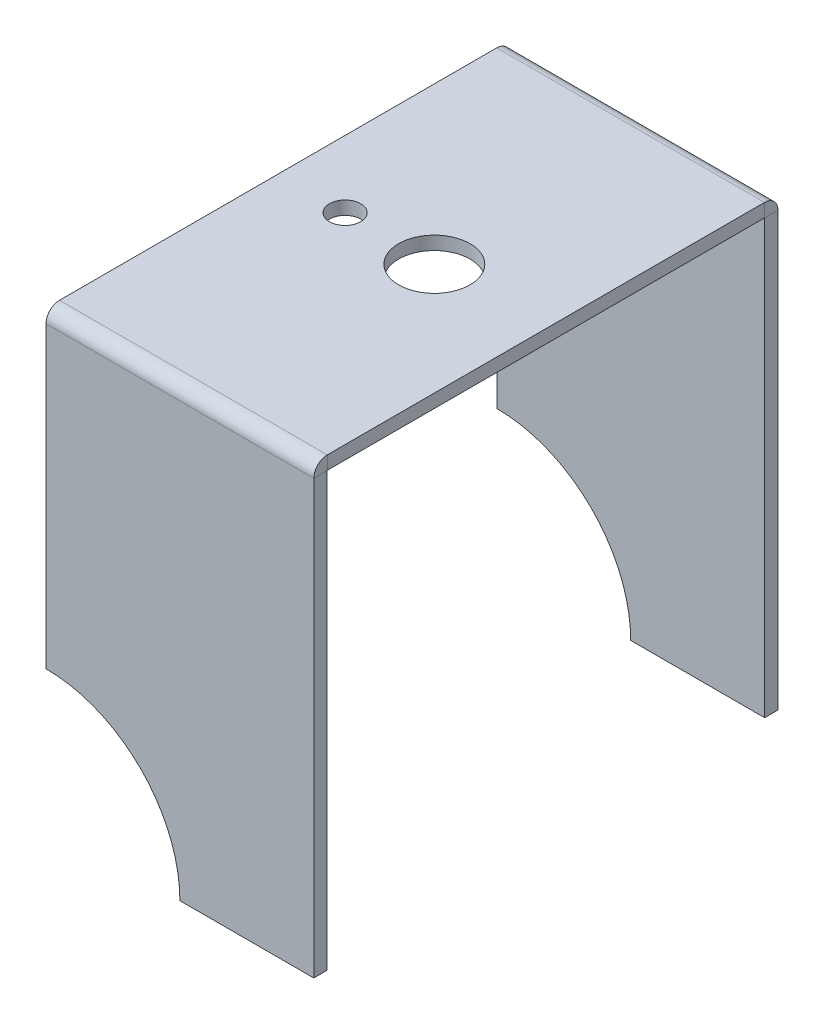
ISO-10303-21;
HEADER;
FILE_DESCRIPTION(('STEP AP214'),'2;1');
FILE_NAME('part.step','',(''),(''),'','','');
FILE_SCHEMA(('AUTOMOTIVE_DESIGN { 1 0 10303 214 1 1 1 1 }'));
ENDSEC;
DATA;
#1=APPLICATION_CONTEXT('core data for automotive mechanical design processes');
#2=APPLICATION_PROTOCOL_DEFINITION('international standard','automotive_design',2000,#1);
#3=PRODUCT_CONTEXT('',#1,'mechanical');
#4=PRODUCT('Part','Part','',(#3));
#5=PRODUCT_RELATED_PRODUCT_CATEGORY('part','',(#4));
#6=PRODUCT_DEFINITION_FORMATION('','',#4);
#7=PRODUCT_DEFINITION_CONTEXT('part definition',#1,'design');
#8=PRODUCT_DEFINITION('design','',#6,#7);
#9=PRODUCT_DEFINITION_SHAPE('','',#8);
#10=(LENGTH_UNIT() NAMED_UNIT(*) SI_UNIT(.MILLI.,.METRE.));
#11=(NAMED_UNIT(*) PLANE_ANGLE_UNIT() SI_UNIT($,.RADIAN.));
#12=(NAMED_UNIT(*) SI_UNIT($,.STERADIAN.) SOLID_ANGLE_UNIT());
#13=UNCERTAINTY_MEASURE_WITH_UNIT(LENGTH_MEASURE(1.E-05),#10,'distance_accuracy_value','');
#14=(GEOMETRIC_REPRESENTATION_CONTEXT(3) GLOBAL_UNCERTAINTY_ASSIGNED_CONTEXT((#13)) GLOBAL_UNIT_ASSIGNED_CONTEXT((#10,
#11,#12)) REPRESENTATION_CONTEXT('',''));
#15=CARTESIAN_POINT('',(0.,0.,0.));
#16=DIRECTION('',(0.,0.,1.));
#17=DIRECTION('',(1.,0.,0.));
#18=AXIS2_PLACEMENT_3D('',#15,#16,#17);
#19=CARTESIAN_POINT('',(-30.,1.5,-152.));
#20=DIRECTION('',(0.,1.,0.));
#21=DIRECTION('',(0.,0.,1.));
#22=AXIS2_PLACEMENT_3D('',#19,#20,#21);
#23=PLANE('',#22);
#24=CARTESIAN_POINT('',(-12.5,1.5,-76.));
#25=DIRECTION('',(0.,1.,0.));
#26=DIRECTION('',(0.,0.,1.));
#27=AXIS2_PLACEMENT_3D('',#24,#25,#26);
#28=CIRCLE('',#27,4.00000000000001);
#29=CARTESIAN_POINT('',(-12.5,1.5,-72.));
#30=VERTEX_POINT('',#29);
#31=EDGE_CURVE('E252',#30,#30,#28,.T.);
#32=ORIENTED_EDGE('',*,*,#31,.F.);
#33=EDGE_LOOP('',(#32));
#34=FACE_BOUND('',#33,.T.);
#35=CARTESIAN_POINT('',(-22.5,1.5,-76.));
#36=DIRECTION('',(0.,1.,0.));
#37=DIRECTION('',(0.,0.,1.));
#38=AXIS2_PLACEMENT_3D('',#35,#36,#37);
#39=CIRCLE('',#38,1.75);
#40=CARTESIAN_POINT('',(-22.5,1.5,-74.25));
#41=VERTEX_POINT('',#40);
#42=EDGE_CURVE('E246',#41,#41,#39,.T.);
#43=ORIENTED_EDGE('',*,*,#42,.F.);
#44=EDGE_LOOP('',(#43));
#45=FACE_BOUND('',#44,.T.);
#46=DIRECTION('',(0.,0.,-1.));
#47=VECTOR('',#46,1.);
#48=CARTESIAN_POINT('',(0.,1.5,0.));
#49=LINE('',#48,#47);
#50=CARTESIAN_POINT('',(0.,1.49999998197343,-51.505));
#51=VERTEX_POINT('',#50);
#52=CARTESIAN_POINT('',(0.,1.5,-100.495));
#53=VERTEX_POINT('',#52);
#54=EDGE_CURVE('E44',#51,#53,#49,.T.);
#55=ORIENTED_EDGE('',*,*,#54,.T.);
#56=DIRECTION('',(-1.,0.,0.));
#57=VECTOR('',#56,1.);
#58=CARTESIAN_POINT('',(-30.,1.5,-100.495));
#59=LINE('',#58,#57);
#60=CARTESIAN_POINT('',(-30.,1.5000000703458,-100.495));
#61=VERTEX_POINT('',#60);
#62=EDGE_CURVE('E265',#53,#61,#59,.T.);
#63=ORIENTED_EDGE('',*,*,#62,.T.);
#64=DIRECTION('',(0.,0.,1.));
#65=VECTOR('',#64,1.);
#66=CARTESIAN_POINT('',(-30.,1.5,-15.));
#67=LINE('',#66,#65);
#68=CARTESIAN_POINT('',(-30.,1.49999996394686,-51.505));
#69=VERTEX_POINT('',#68);
#70=EDGE_CURVE('E258',#61,#69,#67,.T.);
#71=ORIENTED_EDGE('',*,*,#70,.T.);
#72=DIRECTION('',(-1.,0.,0.));
#73=VECTOR('',#72,1.);
#74=CARTESIAN_POINT('',(-30.,1.5,-51.505));
#75=LINE('',#74,#73);
#76=EDGE_CURVE('E255',#51,#69,#75,.T.);
#77=ORIENTED_EDGE('',*,*,#76,.F.);
#78=EDGE_LOOP('',(#55,#63,#71,#77));
#79=FACE_BOUND('',#78,.T.);
#80=ADVANCED_FACE('F40',(#34,#45,#79),#23,.T.);
#81=CARTESIAN_POINT('',(-30.,1.5,-15.));
#82=DIRECTION('',(1.,0.,0.));
#83=DIRECTION('',(0.,0.,-1.));
#84=AXIS2_PLACEMENT_3D('',#81,#82,#83);
#85=PLANE('',#84);
#86=DIRECTION('',(0.,1.,0.));
#87=VECTOR('',#86,1.);
#88=CARTESIAN_POINT('',(-30.,1.49999999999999,-100.495));
#89=LINE('',#88,#87);
#90=CARTESIAN_POINT('',(-30.,0.,-100.495));
#91=VERTEX_POINT('',#90);
#92=EDGE_CURVE('E12',#91,#61,#89,.T.);
#93=ORIENTED_EDGE('',*,*,#92,.F.);
#94=DIRECTION('',(0.,0.,1.));
#95=VECTOR('',#94,1.);
#96=CARTESIAN_POINT('',(-30.,0.,-15.));
#97=LINE('',#96,#95);
#98=CARTESIAN_POINT('',(-30.,-3.60531418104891E-08,-51.505));
#99=VERTEX_POINT('',#98);
#100=EDGE_CURVE('E57',#91,#99,#97,.T.);
#101=ORIENTED_EDGE('',*,*,#100,.T.);
#102=DIRECTION('',(0.,1.,0.));
#103=VECTOR('',#102,1.);
#104=CARTESIAN_POINT('',(-30.,1.5,-51.505));
#105=LINE('',#104,#103);
#106=EDGE_CURVE('E257',#99,#69,#105,.T.);
#107=ORIENTED_EDGE('',*,*,#106,.T.);
#108=ORIENTED_EDGE('',*,*,#70,.F.);
#109=EDGE_LOOP('',(#93,#101,#107,#108));
#110=FACE_BOUND('',#109,.T.);
#111=ADVANCED_FACE('F42',(#110),#85,.F.);
#112=CARTESIAN_POINT('',(0.,1.5,0.));
#113=DIRECTION('',(-1.,0.,0.));
#114=DIRECTION('',(0.,0.,1.));
#115=AXIS2_PLACEMENT_3D('',#112,#113,#114);
#116=PLANE('',#115);
#117=DIRECTION('',(0.,-1.,0.));
#118=VECTOR('',#117,1.);
#119=CARTESIAN_POINT('',(0.,1.49999999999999,-100.495));
#120=LINE('',#119,#118);
#121=CARTESIAN_POINT('',(0.,0.,-100.495));
#122=VERTEX_POINT('',#121);
#123=EDGE_CURVE('E268',#53,#122,#120,.T.);
#124=ORIENTED_EDGE('',*,*,#123,.F.);
#125=ORIENTED_EDGE('',*,*,#54,.F.);
#126=DIRECTION('',(0.,-1.,0.));
#127=VECTOR('',#126,1.);
#128=CARTESIAN_POINT('',(0.,1.5,-51.505));
#129=LINE('',#128,#127);
#130=CARTESIAN_POINT('',(0.,0.,-51.505));
#131=VERTEX_POINT('',#130);
#132=EDGE_CURVE('E263',#51,#131,#129,.T.);
#133=ORIENTED_EDGE('',*,*,#132,.T.);
#134=DIRECTION('',(0.,0.,-1.));
#135=VECTOR('',#134,1.);
#136=CARTESIAN_POINT('',(0.,0.,0.));
#137=LINE('',#136,#135);
#138=EDGE_CURVE('E65',#131,#122,#137,.T.);
#139=ORIENTED_EDGE('',*,*,#138,.T.);
#140=EDGE_LOOP('',(#124,#125,#133,#139));
#141=FACE_BOUND('',#140,.T.);
#142=ADVANCED_FACE('F279',(#141),#116,.F.);
#143=CARTESIAN_POINT('',(-30.,0.,-152.));
#144=DIRECTION('',(0.,1.,0.));
#145=DIRECTION('',(0.,0.,1.));
#146=AXIS2_PLACEMENT_3D('',#143,#144,#145);
#147=PLANE('',#146);
#148=DIRECTION('',(-1.,0.,0.));
#149=VECTOR('',#148,1.);
#150=CARTESIAN_POINT('',(-30.,0.,-100.495));
#151=LINE('',#150,#149);
#152=EDGE_CURVE('E49',#122,#91,#151,.T.);
#153=ORIENTED_EDGE('',*,*,#152,.F.);
#154=ORIENTED_EDGE('',*,*,#138,.F.);
#155=DIRECTION('',(-1.,0.,0.));
#156=VECTOR('',#155,1.);
#157=CARTESIAN_POINT('',(-30.,0.,-51.505));
#158=LINE('',#157,#156);
#159=EDGE_CURVE('E261',#131,#99,#158,.T.);
#160=ORIENTED_EDGE('',*,*,#159,.T.);
#161=ORIENTED_EDGE('',*,*,#100,.F.);
#162=EDGE_LOOP('',(#153,#154,#160,#161));
#163=FACE_BOUND('',#162,.T.);
#164=CARTESIAN_POINT('',(-22.5,0.,-76.));
#165=DIRECTION('',(0.,1.,0.));
#166=DIRECTION('',(0.,0.,1.));
#167=AXIS2_PLACEMENT_3D('',#164,#165,#166);
#168=CIRCLE('',#167,1.75);
#169=CARTESIAN_POINT('',(-22.5,0.,-74.25));
#170=VERTEX_POINT('',#169);
#171=EDGE_CURVE('E243',#170,#170,#168,.T.);
#172=ORIENTED_EDGE('',*,*,#171,.T.);
#173=EDGE_LOOP('',(#172));
#174=FACE_BOUND('',#173,.T.);
#175=CARTESIAN_POINT('',(-12.5,0.,-76.));
#176=DIRECTION('',(0.,1.,0.));
#177=DIRECTION('',(0.,0.,1.));
#178=AXIS2_PLACEMENT_3D('',#175,#176,#177);
#179=CIRCLE('',#178,4.00000000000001);
#180=CARTESIAN_POINT('',(-12.5,0.,-72.));
#181=VERTEX_POINT('',#180);
#182=EDGE_CURVE('E249',#181,#181,#179,.T.);
#183=ORIENTED_EDGE('',*,*,#182,.T.);
#184=EDGE_LOOP('',(#183));
#185=FACE_BOUND('',#184,.T.);
#186=ADVANCED_FACE('F313',(#163,#174,#185),#147,.F.);
#187=CARTESIAN_POINT('',(-12.5,1.5,-76.));
#188=DIRECTION('',(0.,-1.,0.));
#189=DIRECTION('',(0.,0.,-1.));
#190=AXIS2_PLACEMENT_3D('',#187,#188,#189);
#191=CYLINDRICAL_SURFACE('',#190,4.00000000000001);
#192=ORIENTED_EDGE('',*,*,#31,.T.);
#193=EDGE_LOOP('',(#192));
#194=FACE_BOUND('',#193,.T.);
#195=ORIENTED_EDGE('',*,*,#182,.F.);
#196=EDGE_LOOP('',(#195));
#197=FACE_BOUND('',#196,.T.);
#198=ADVANCED_FACE('F371',(#194,#197),#191,.F.);
#199=CARTESIAN_POINT('',(-22.5,1.5,-76.));
#200=DIRECTION('',(0.,-1.,0.));
#201=DIRECTION('',(0.,0.,-1.));
#202=AXIS2_PLACEMENT_3D('',#199,#200,#201);
#203=CYLINDRICAL_SURFACE('',#202,1.75);
#204=ORIENTED_EDGE('',*,*,#42,.T.);
#205=EDGE_LOOP('',(#204));
#206=FACE_BOUND('',#205,.T.);
#207=ORIENTED_EDGE('',*,*,#171,.F.);
#208=EDGE_LOOP('',(#207));
#209=FACE_BOUND('',#208,.T.);
#210=ADVANCED_FACE('F378',(#206,#209),#203,.F.);
#211=CARTESIAN_POINT('',(0.,-0.00999996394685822,-51.505));
#212=DIRECTION('',(1.,0.,0.));
#213=DIRECTION('',(0.,0.,-1.));
#214=AXIS2_PLACEMENT_3D('',#211,#212,#213);
#215=PLANE('',#214);
#216=DIRECTION('',(0.,0.,-1.));
#217=VECTOR('',#216,1.);
#218=CARTESIAN_POINT('',(0.,-0.0100000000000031,-49.995));
#219=LINE('',#218,#217);
#220=CARTESIAN_POINT('',(0.,-0.010000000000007,-49.9950000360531));
#221=VERTEX_POINT('',#220);
#222=CARTESIAN_POINT('',(0.,-0.00999999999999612,-51.495));
#223=VERTEX_POINT('',#222);
#224=EDGE_CURVE('E195',#221,#223,#219,.T.);
#225=ORIENTED_EDGE('',*,*,#224,.T.);
#226=CARTESIAN_POINT('',(0.,-0.01,-51.505));
#227=DIRECTION('',(1.,0.,0.));
#228=DIRECTION('',(0.,0.,-1.));
#229=AXIS2_PLACEMENT_3D('',#226,#227,#228);
#230=CIRCLE('',#229,0.00999996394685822);
#231=EDGE_CURVE('E198',#223,#131,#230,.F.);
#232=ORIENTED_EDGE('',*,*,#231,.T.);
#233=ORIENTED_EDGE('',*,*,#132,.F.);
#234=CARTESIAN_POINT('',(0.,-0.00999996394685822,-51.505));
#235=DIRECTION('',(-1.,0.,0.));
#236=DIRECTION('',(0.,0.,1.));
#237=AXIS2_PLACEMENT_3D('',#234,#235,#236);
#238=CIRCLE('',#237,1.50999994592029);
#239=EDGE_CURVE('E237',#221,#51,#238,.T.);
#240=ORIENTED_EDGE('',*,*,#239,.F.);
#241=EDGE_LOOP('',(#225,#232,#233,#240));
#242=FACE_BOUND('',#241,.T.);
#243=ADVANCED_FACE('F318',(#242),#215,.T.);
#244=CARTESIAN_POINT('',(-30.,-0.00999996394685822,-51.505));
#245=DIRECTION('',(-1.,0.,0.));
#246=DIRECTION('',(0.,0.,1.));
#247=AXIS2_PLACEMENT_3D('',#244,#245,#246);
#248=PLANE('',#247);
#249=CARTESIAN_POINT('',(-30.,-0.01,-51.505));
#250=DIRECTION('',(1.,0.,0.));
#251=DIRECTION('',(0.,0.,-1.));
#252=AXIS2_PLACEMENT_3D('',#249,#250,#251);
#253=CIRCLE('',#252,0.00999996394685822);
#254=CARTESIAN_POINT('',(-30.,-0.00999999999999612,-51.495));
#255=VERTEX_POINT('',#254);
#256=EDGE_CURVE('E234',#99,#255,#253,.T.);
#257=ORIENTED_EDGE('',*,*,#256,.T.);
#258=DIRECTION('',(0.,0.,1.));
#259=VECTOR('',#258,1.);
#260=CARTESIAN_POINT('',(-30.,-0.0100000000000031,-49.995));
#261=LINE('',#260,#259);
#262=CARTESIAN_POINT('',(-30.,-0.0100000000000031,-49.995));
#263=VERTEX_POINT('',#262);
#264=EDGE_CURVE('E225',#255,#263,#261,.T.);
#265=ORIENTED_EDGE('',*,*,#264,.T.);
#266=CARTESIAN_POINT('',(-30.,-0.00999996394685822,-51.505));
#267=DIRECTION('',(1.,0.,0.));
#268=DIRECTION('',(0.,0.,-1.));
#269=AXIS2_PLACEMENT_3D('',#266,#267,#268);
#270=CIRCLE('',#269,1.50999994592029);
#271=EDGE_CURVE('E240',#69,#263,#270,.T.);
#272=ORIENTED_EDGE('',*,*,#271,.F.);
#273=ORIENTED_EDGE('',*,*,#106,.F.);
#274=EDGE_LOOP('',(#257,#265,#272,#273));
#275=FACE_BOUND('',#274,.T.);
#276=ADVANCED_FACE('F334',(#275),#248,.T.);
#277=CARTESIAN_POINT('',(-45.1879131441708,-0.01,-51.505));
#278=DIRECTION('',(1.,0.,0.));
#279=DIRECTION('',(0.,0.,-1.));
#280=AXIS2_PLACEMENT_3D('',#277,#278,#279);
#281=CYLINDRICAL_SURFACE('',#280,1.50999996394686);
#282=ORIENTED_EDGE('',*,*,#76,.T.);
#283=ORIENTED_EDGE('',*,*,#271,.T.);
#284=DIRECTION('',(-1.,0.,0.));
#285=VECTOR('',#284,1.);
#286=CARTESIAN_POINT('',(-30.,-0.0100000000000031,-49.995));
#287=LINE('',#286,#285);
#288=EDGE_CURVE('E210',#221,#263,#287,.T.);
#289=ORIENTED_EDGE('',*,*,#288,.F.);
#290=ORIENTED_EDGE('',*,*,#239,.T.);
#291=EDGE_LOOP('',(#282,#283,#289,#290));
#292=FACE_BOUND('',#291,.T.);
#293=ADVANCED_FACE('F322',(#292),#281,.T.);
#294=CARTESIAN_POINT('',(-45.1879131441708,-0.01,-51.505));
#295=DIRECTION('',(1.,0.,0.));
#296=DIRECTION('',(0.,0.,-1.));
#297=AXIS2_PLACEMENT_3D('',#294,#295,#296);
#298=CYLINDRICAL_SURFACE('',#297,0.00999996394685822);
#299=ORIENTED_EDGE('',*,*,#159,.F.);
#300=ORIENTED_EDGE('',*,*,#231,.F.);
#301=DIRECTION('',(-1.,0.,0.));
#302=VECTOR('',#301,1.);
#303=CARTESIAN_POINT('',(-30.,-0.00999999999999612,-51.495));
#304=LINE('',#303,#302);
#305=EDGE_CURVE('E228',#223,#255,#304,.T.);
#306=ORIENTED_EDGE('',*,*,#305,.T.);
#307=ORIENTED_EDGE('',*,*,#256,.F.);
#308=EDGE_LOOP('',(#299,#300,#306,#307));
#309=FACE_BOUND('',#308,.T.);
#310=ADVANCED_FACE('F337',(#309),#298,.F.);
#311=CARTESIAN_POINT('',(0.,-48.505,-49.9950000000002));
#312=DIRECTION('',(0.,1.,0.));
#313=DIRECTION('',(-1.,0.,0.));
#314=AXIS2_PLACEMENT_3D('',#311,#312,#313);
#315=PLANE('',#314);
#316=DIRECTION('',(1.,0.,0.));
#317=VECTOR('',#316,1.);
#318=CARTESIAN_POINT('',(0.,-48.505,-51.4950000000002));
#319=LINE('',#318,#317);
#320=CARTESIAN_POINT('',(-15.,-48.505,-51.4950000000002));
#321=VERTEX_POINT('',#320);
#322=CARTESIAN_POINT('',(0.,-48.505,-51.4950000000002));
#323=VERTEX_POINT('',#322);
#324=EDGE_CURVE('E223',#321,#323,#319,.T.);
#325=ORIENTED_EDGE('',*,*,#324,.T.);
#326=DIRECTION('',(0.,0.,-1.));
#327=VECTOR('',#326,1.);
#328=CARTESIAN_POINT('',(0.,-48.505,-49.9950000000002));
#329=LINE('',#328,#327);
#330=CARTESIAN_POINT('',(0.,-48.505,-49.9950000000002));
#331=VERTEX_POINT('',#330);
#332=EDGE_CURVE('E199',#331,#323,#329,.T.);
#333=ORIENTED_EDGE('',*,*,#332,.F.);
#334=DIRECTION('',(1.,0.,0.));
#335=VECTOR('',#334,1.);
#336=CARTESIAN_POINT('',(0.,-48.505,-49.9950000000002));
#337=LINE('',#336,#335);
#338=CARTESIAN_POINT('',(-15.,-48.505,-49.9950000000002));
#339=VERTEX_POINT('',#338);
#340=EDGE_CURVE('E204',#339,#331,#337,.T.);
#341=ORIENTED_EDGE('',*,*,#340,.F.);
#342=DIRECTION('',(0.,0.,-1.));
#343=VECTOR('',#342,1.);
#344=CARTESIAN_POINT('',(-15.,-48.505,-49.9950000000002));
#345=LINE('',#344,#343);
#346=EDGE_CURVE('E220',#339,#321,#345,.T.);
#347=ORIENTED_EDGE('',*,*,#346,.T.);
#348=EDGE_LOOP('',(#325,#333,#341,#347));
#349=FACE_BOUND('',#348,.T.);
#350=ADVANCED_FACE('F349',(#349),#315,.F.);
#351=CARTESIAN_POINT('',(-30.,-48.505,-49.9950000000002));
#352=DIRECTION('',(0.,0.,-1.));
#353=DIRECTION('',(0.,1.,0.));
#354=AXIS2_PLACEMENT_3D('',#351,#352,#353);
#355=CYLINDRICAL_SURFACE('',#354,15.);
#356=CARTESIAN_POINT('',(-30.,-48.505,-51.4950000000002));
#357=DIRECTION('',(0.,0.,-1.));
#358=DIRECTION('',(0.,-1.,0.));
#359=AXIS2_PLACEMENT_3D('',#356,#357,#358);
#360=CIRCLE('',#359,15.);
#361=CARTESIAN_POINT('',(-30.,-33.505,-51.4950000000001));
#362=VERTEX_POINT('',#361);
#363=EDGE_CURVE('E218',#362,#321,#360,.T.);
#364=ORIENTED_EDGE('',*,*,#363,.T.);
#365=ORIENTED_EDGE('',*,*,#346,.F.);
#366=CARTESIAN_POINT('',(-30.,-48.505,-49.9950000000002));
#367=DIRECTION('',(0.,0.,-1.));
#368=DIRECTION('',(0.,-1.,0.));
#369=AXIS2_PLACEMENT_3D('',#366,#367,#368);
#370=CIRCLE('',#369,15.);
#371=CARTESIAN_POINT('',(-30.,-33.505,-49.9950000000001));
#372=VERTEX_POINT('',#371);
#373=EDGE_CURVE('E206',#372,#339,#370,.T.);
#374=ORIENTED_EDGE('',*,*,#373,.F.);
#375=DIRECTION('',(0.,0.,-1.));
#376=VECTOR('',#375,1.);
#377=CARTESIAN_POINT('',(-30.,-33.505,-49.9950000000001));
#378=LINE('',#377,#376);
#379=EDGE_CURVE('E215',#372,#362,#378,.T.);
#380=ORIENTED_EDGE('',*,*,#379,.T.);
#381=EDGE_LOOP('',(#364,#365,#374,#380));
#382=FACE_BOUND('',#381,.T.);
#383=ADVANCED_FACE('F352',(#382),#355,.F.);
#384=CARTESIAN_POINT('',(-30.,103.495,-49.9949999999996));
#385=DIRECTION('',(0.,0.,1.));
#386=DIRECTION('',(0.,-1.,0.));
#387=AXIS2_PLACEMENT_3D('',#384,#385,#386);
#388=PLANE('',#387);
#389=DIRECTION('',(0.,1.,0.));
#390=VECTOR('',#389,1.);
#391=CARTESIAN_POINT('',(0.,-48.505,-49.9950000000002));
#392=LINE('',#391,#390);
#393=EDGE_CURVE('E212',#331,#221,#392,.T.);
#394=ORIENTED_EDGE('',*,*,#393,.T.);
#395=ORIENTED_EDGE('',*,*,#288,.T.);
#396=DIRECTION('',(0.,-1.,0.));
#397=VECTOR('',#396,1.);
#398=CARTESIAN_POINT('',(-30.,-33.505,-49.9950000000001));
#399=LINE('',#398,#397);
#400=EDGE_CURVE('E208',#263,#372,#399,.T.);
#401=ORIENTED_EDGE('',*,*,#400,.T.);
#402=ORIENTED_EDGE('',*,*,#373,.T.);
#403=ORIENTED_EDGE('',*,*,#340,.T.);
#404=EDGE_LOOP('',(#394,#395,#401,#402,#403));
#405=FACE_BOUND('',#404,.T.);
#406=ADVANCED_FACE('F326',(#405),#388,.T.);
#407=CARTESIAN_POINT('',(-30.,-33.505,-49.9950000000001));
#408=DIRECTION('',(1.,0.,0.));
#409=DIRECTION('',(0.,1.,0.));
#410=AXIS2_PLACEMENT_3D('',#407,#408,#409);
#411=PLANE('',#410);
#412=ORIENTED_EDGE('',*,*,#264,.F.);
#413=DIRECTION('',(0.,-1.,0.));
#414=VECTOR('',#413,1.);
#415=CARTESIAN_POINT('',(-30.,-33.505,-51.4950000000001));
#416=LINE('',#415,#414);
#417=EDGE_CURVE('E202',#255,#362,#416,.T.);
#418=ORIENTED_EDGE('',*,*,#417,.T.);
#419=ORIENTED_EDGE('',*,*,#379,.F.);
#420=ORIENTED_EDGE('',*,*,#400,.F.);
#421=EDGE_LOOP('',(#412,#418,#419,#420));
#422=FACE_BOUND('',#421,.T.);
#423=ADVANCED_FACE('F331',(#422),#411,.F.);
#424=CARTESIAN_POINT('',(-30.,103.495,-51.4949999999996));
#425=DIRECTION('',(0.,0.,1.));
#426=DIRECTION('',(0.,-1.,0.));
#427=AXIS2_PLACEMENT_3D('',#424,#425,#426);
#428=PLANE('',#427);
#429=ORIENTED_EDGE('',*,*,#305,.F.);
#430=DIRECTION('',(0.,1.,0.));
#431=VECTOR('',#430,1.);
#432=CARTESIAN_POINT('',(0.,-48.505,-51.4950000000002));
#433=LINE('',#432,#431);
#434=EDGE_CURVE('E196',#323,#223,#433,.T.);
#435=ORIENTED_EDGE('',*,*,#434,.F.);
#436=ORIENTED_EDGE('',*,*,#324,.F.);
#437=ORIENTED_EDGE('',*,*,#363,.F.);
#438=ORIENTED_EDGE('',*,*,#417,.F.);
#439=EDGE_LOOP('',(#429,#435,#436,#437,#438));
#440=FACE_BOUND('',#439,.T.);
#441=ADVANCED_FACE('F341',(#440),#428,.F.);
#442=CARTESIAN_POINT('',(0.,-48.505,-49.9950000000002));
#443=DIRECTION('',(-1.,0.,0.));
#444=DIRECTION('',(0.,-1.,0.));
#445=AXIS2_PLACEMENT_3D('',#442,#443,#444);
#446=PLANE('',#445);
#447=ORIENTED_EDGE('',*,*,#224,.F.);
#448=ORIENTED_EDGE('',*,*,#393,.F.);
#449=ORIENTED_EDGE('',*,*,#332,.T.);
#450=ORIENTED_EDGE('',*,*,#434,.T.);
#451=EDGE_LOOP('',(#447,#448,#449,#450));
#452=FACE_BOUND('',#451,.T.);
#453=ADVANCED_FACE('F345',(#452),#446,.F.);
#454=CARTESIAN_POINT('',(0.,-0.0100000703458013,-100.495));
#455=DIRECTION('',(1.,0.,0.));
#456=DIRECTION('',(0.,1.,0.));
#457=AXIS2_PLACEMENT_3D('',#454,#455,#456);
#458=PLANE('',#457);
#459=ORIENTED_EDGE('',*,*,#123,.T.);
#460=CARTESIAN_POINT('',(0.,-0.01,-100.495));
#461=DIRECTION('',(-1.,0.,0.));
#462=DIRECTION('',(0.,0.,1.));
#463=AXIS2_PLACEMENT_3D('',#460,#461,#462);
#464=CIRCLE('',#463,0.0100000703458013);
#465=CARTESIAN_POINT('',(0.,-0.01000000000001,-100.505));
#466=VERTEX_POINT('',#465);
#467=EDGE_CURVE('E182',#122,#466,#464,.T.);
#468=ORIENTED_EDGE('',*,*,#467,.T.);
#469=DIRECTION('',(0.,0.,1.));
#470=VECTOR('',#469,1.);
#471=CARTESIAN_POINT('',(0.,-0.01000000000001,-102.005));
#472=LINE('',#471,#470);
#473=CARTESIAN_POINT('',(0.,-0.01000000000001,-102.005));
#474=VERTEX_POINT('',#473);
#475=EDGE_CURVE('E153',#474,#466,#472,.T.);
#476=ORIENTED_EDGE('',*,*,#475,.F.);
#477=CARTESIAN_POINT('',(0.,-0.0100000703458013,-100.495));
#478=DIRECTION('',(-1.,0.,0.));
#479=DIRECTION('',(0.,-1.,0.));
#480=AXIS2_PLACEMENT_3D('',#477,#478,#479);
#481=CIRCLE('',#480,1.5100001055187);
#482=EDGE_CURVE('E189',#53,#474,#481,.T.);
#483=ORIENTED_EDGE('',*,*,#482,.F.);
#484=EDGE_LOOP('',(#459,#468,#476,#483));
#485=FACE_BOUND('',#484,.T.);
#486=ADVANCED_FACE('F286',(#485),#458,.T.);
#487=CARTESIAN_POINT('',(-30.,-0.0100000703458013,-100.495));
#488=DIRECTION('',(-1.,0.,0.));
#489=DIRECTION('',(0.,0.,1.));
#490=AXIS2_PLACEMENT_3D('',#487,#488,#489);
#491=PLANE('',#490);
#492=CARTESIAN_POINT('',(-30.,-0.01,-100.495));
#493=DIRECTION('',(-1.,0.,0.));
#494=DIRECTION('',(0.,0.,1.));
#495=AXIS2_PLACEMENT_3D('',#492,#493,#494);
#496=CIRCLE('',#495,0.0100000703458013);
#497=CARTESIAN_POINT('',(-30.,-0.01000000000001,-100.505));
#498=VERTEX_POINT('',#497);
#499=EDGE_CURVE('E185',#498,#91,#496,.F.);
#500=ORIENTED_EDGE('',*,*,#499,.T.);
#501=ORIENTED_EDGE('',*,*,#92,.T.);
#502=CARTESIAN_POINT('',(-30.,-0.0100000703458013,-100.495));
#503=DIRECTION('',(1.,0.,0.));
#504=DIRECTION('',(0.,0.,-1.));
#505=AXIS2_PLACEMENT_3D('',#502,#503,#504);
#506=CIRCLE('',#505,1.5100001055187);
#507=CARTESIAN_POINT('',(-30.,-0.010000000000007,-102.005000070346));
#508=VERTEX_POINT('',#507);
#509=EDGE_CURVE('E192',#508,#61,#506,.T.);
#510=ORIENTED_EDGE('',*,*,#509,.F.);
#511=DIRECTION('',(0.,0.,-1.));
#512=VECTOR('',#511,1.);
#513=CARTESIAN_POINT('',(-30.,-0.01000000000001,-102.005));
#514=LINE('',#513,#512);
#515=EDGE_CURVE('E303',#498,#508,#514,.T.);
#516=ORIENTED_EDGE('',*,*,#515,.F.);
#517=EDGE_LOOP('',(#500,#501,#510,#516));
#518=FACE_BOUND('',#517,.T.);
#519=ADVANCED_FACE('F308',(#518),#491,.T.);
#520=CARTESIAN_POINT('',(15.1879131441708,-0.01,-100.495));
#521=DIRECTION('',(-1.,0.,0.));
#522=DIRECTION('',(0.,0.,1.));
#523=AXIS2_PLACEMENT_3D('',#520,#521,#522);
#524=CYLINDRICAL_SURFACE('',#523,1.5100000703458);
#525=DIRECTION('',(-1.,0.,0.));
#526=VECTOR('',#525,1.);
#527=CARTESIAN_POINT('',(-30.,-0.01000000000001,-102.005));
#528=LINE('',#527,#526);
#529=EDGE_CURVE('E179',#474,#508,#528,.T.);
#530=ORIENTED_EDGE('',*,*,#529,.T.);
#531=ORIENTED_EDGE('',*,*,#509,.T.);
#532=ORIENTED_EDGE('',*,*,#62,.F.);
#533=ORIENTED_EDGE('',*,*,#482,.T.);
#534=EDGE_LOOP('',(#530,#531,#532,#533));
#535=FACE_BOUND('',#534,.T.);
#536=ADVANCED_FACE('F284',(#535),#524,.T.);
#537=CARTESIAN_POINT('',(15.1879131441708,-0.01,-100.495));
#538=DIRECTION('',(-1.,0.,0.));
#539=DIRECTION('',(0.,0.,1.));
#540=AXIS2_PLACEMENT_3D('',#537,#538,#539);
#541=CYLINDRICAL_SURFACE('',#540,0.0100000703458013);
#542=DIRECTION('',(-1.,0.,0.));
#543=VECTOR('',#542,1.);
#544=CARTESIAN_POINT('',(-30.,-0.01000000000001,-100.505));
#545=LINE('',#544,#543);
#546=EDGE_CURVE('E157',#466,#498,#545,.T.);
#547=ORIENTED_EDGE('',*,*,#546,.F.);
#548=ORIENTED_EDGE('',*,*,#467,.F.);
#549=ORIENTED_EDGE('',*,*,#152,.T.);
#550=ORIENTED_EDGE('',*,*,#499,.F.);
#551=EDGE_LOOP('',(#547,#548,#549,#550));
#552=FACE_BOUND('',#551,.T.);
#553=ADVANCED_FACE('F312',(#552),#541,.F.);
#554=CARTESIAN_POINT('',(-30.,-48.505,-102.005));
#555=DIRECTION('',(0.,0.,1.));
#556=DIRECTION('',(0.,-1.,0.));
#557=AXIS2_PLACEMENT_3D('',#554,#555,#556);
#558=CYLINDRICAL_SURFACE('',#557,15.);
#559=CARTESIAN_POINT('',(-30.,-48.505,-100.505));
#560=DIRECTION('',(0.,0.,1.));
#561=DIRECTION('',(0.,1.,0.));
#562=AXIS2_PLACEMENT_3D('',#559,#560,#561);
#563=CIRCLE('',#562,15.);
#564=CARTESIAN_POINT('',(-15.,-48.505,-100.505));
#565=VERTEX_POINT('',#564);
#566=CARTESIAN_POINT('',(-30.,-33.505,-100.505));
#567=VERTEX_POINT('',#566);
#568=EDGE_CURVE('E163',#565,#567,#563,.T.);
#569=ORIENTED_EDGE('',*,*,#568,.T.);
#570=DIRECTION('',(0.,0.,1.));
#571=VECTOR('',#570,1.);
#572=CARTESIAN_POINT('',(-30.,-33.505,-102.005));
#573=LINE('',#572,#571);
#574=CARTESIAN_POINT('',(-30.,-33.505,-102.005));
#575=VERTEX_POINT('',#574);
#576=EDGE_CURVE('E186',#575,#567,#573,.T.);
#577=ORIENTED_EDGE('',*,*,#576,.F.);
#578=CARTESIAN_POINT('',(-30.,-48.505,-102.005));
#579=DIRECTION('',(0.,0.,1.));
#580=DIRECTION('',(0.,1.,0.));
#581=AXIS2_PLACEMENT_3D('',#578,#579,#580);
#582=CIRCLE('',#581,15.);
#583=CARTESIAN_POINT('',(-15.,-48.505,-102.005));
#584=VERTEX_POINT('',#583);
#585=EDGE_CURVE('E290',#584,#575,#582,.T.);
#586=ORIENTED_EDGE('',*,*,#585,.F.);
#587=DIRECTION('',(0.,0.,1.));
#588=VECTOR('',#587,1.);
#589=CARTESIAN_POINT('',(-15.,-48.505,-102.005));
#590=LINE('',#589,#588);
#591=EDGE_CURVE('E167',#584,#565,#590,.T.);
#592=ORIENTED_EDGE('',*,*,#591,.T.);
#593=EDGE_LOOP('',(#569,#577,#586,#592));
#594=FACE_BOUND('',#593,.T.);
#595=ADVANCED_FACE('F299',(#594),#558,.F.);
#596=CARTESIAN_POINT('',(0.,-48.505,-102.005));
#597=DIRECTION('',(0.,1.,0.));
#598=DIRECTION('',(1.,0.,0.));
#599=AXIS2_PLACEMENT_3D('',#596,#597,#598);
#600=PLANE('',#599);
#601=DIRECTION('',(-1.,0.,0.));
#602=VECTOR('',#601,1.);
#603=CARTESIAN_POINT('',(0.,-48.505,-100.505));
#604=LINE('',#603,#602);
#605=CARTESIAN_POINT('',(0.,-48.505,-100.505));
#606=VERTEX_POINT('',#605);
#607=EDGE_CURVE('E160',#606,#565,#604,.T.);
#608=ORIENTED_EDGE('',*,*,#607,.T.);
#609=ORIENTED_EDGE('',*,*,#591,.F.);
#610=DIRECTION('',(-1.,0.,0.));
#611=VECTOR('',#610,1.);
#612=CARTESIAN_POINT('',(0.,-48.505,-102.005));
#613=LINE('',#612,#611);
#614=CARTESIAN_POINT('',(0.,-48.505,-102.005));
#615=VERTEX_POINT('',#614);
#616=EDGE_CURVE('E171',#615,#584,#613,.T.);
#617=ORIENTED_EDGE('',*,*,#616,.F.);
#618=DIRECTION('',(0.,0.,1.));
#619=VECTOR('',#618,1.);
#620=CARTESIAN_POINT('',(0.,-48.505,-102.005));
#621=LINE('',#620,#619);
#622=EDGE_CURVE('E151',#615,#606,#621,.T.);
#623=ORIENTED_EDGE('',*,*,#622,.T.);
#624=EDGE_LOOP('',(#608,#609,#617,#623));
#625=FACE_BOUND('',#624,.T.);
#626=ADVANCED_FACE('F170',(#625),#600,.F.);
#627=CARTESIAN_POINT('',(-30.,-48.505,-102.005));
#628=DIRECTION('',(0.,0.,-1.));
#629=DIRECTION('',(0.,1.,0.));
#630=AXIS2_PLACEMENT_3D('',#627,#628,#629);
#631=PLANE('',#630);
#632=ORIENTED_EDGE('',*,*,#529,.F.);
#633=DIRECTION('',(0.,-1.,0.));
#634=VECTOR('',#633,1.);
#635=CARTESIAN_POINT('',(0.,103.495,-102.005));
#636=LINE('',#635,#634);
#637=EDGE_CURVE('E172',#474,#615,#636,.T.);
#638=ORIENTED_EDGE('',*,*,#637,.T.);
#639=ORIENTED_EDGE('',*,*,#616,.T.);
#640=ORIENTED_EDGE('',*,*,#585,.T.);
#641=DIRECTION('',(0.,1.,0.));
#642=VECTOR('',#641,1.);
#643=CARTESIAN_POINT('',(-30.,88.495,-102.005));
#644=LINE('',#643,#642);
#645=EDGE_CURVE('E287',#575,#508,#644,.T.);
#646=ORIENTED_EDGE('',*,*,#645,.T.);
#647=EDGE_LOOP('',(#632,#638,#639,#640,#646));
#648=FACE_BOUND('',#647,.T.);
#649=ADVANCED_FACE('F295',(#648),#631,.T.);
#650=CARTESIAN_POINT('',(0.,103.495,-102.005));
#651=DIRECTION('',(-1.,0.,0.));
#652=DIRECTION('',(0.,1.,0.));
#653=AXIS2_PLACEMENT_3D('',#650,#651,#652);
#654=PLANE('',#653);
#655=ORIENTED_EDGE('',*,*,#637,.F.);
#656=ORIENTED_EDGE('',*,*,#475,.T.);
#657=DIRECTION('',(0.,-1.,0.));
#658=VECTOR('',#657,1.);
#659=CARTESIAN_POINT('',(0.,103.495,-100.505));
#660=LINE('',#659,#658);
#661=EDGE_CURVE('E146',#466,#606,#660,.T.);
#662=ORIENTED_EDGE('',*,*,#661,.T.);
#663=ORIENTED_EDGE('',*,*,#622,.F.);
#664=EDGE_LOOP('',(#655,#656,#662,#663));
#665=FACE_BOUND('',#664,.T.);
#666=ADVANCED_FACE('F149',(#665),#654,.F.);
#667=CARTESIAN_POINT('',(-30.,-48.505,-100.505));
#668=DIRECTION('',(0.,0.,-1.));
#669=DIRECTION('',(0.,1.,0.));
#670=AXIS2_PLACEMENT_3D('',#667,#668,#669);
#671=PLANE('',#670);
#672=ORIENTED_EDGE('',*,*,#661,.F.);
#673=ORIENTED_EDGE('',*,*,#546,.T.);
#674=DIRECTION('',(0.,1.,0.));
#675=VECTOR('',#674,1.);
#676=CARTESIAN_POINT('',(-30.,88.495,-100.505));
#677=LINE('',#676,#675);
#678=EDGE_CURVE('E624',#567,#498,#677,.T.);
#679=ORIENTED_EDGE('',*,*,#678,.F.);
#680=ORIENTED_EDGE('',*,*,#568,.F.);
#681=ORIENTED_EDGE('',*,*,#607,.F.);
#682=EDGE_LOOP('',(#672,#673,#679,#680,#681));
#683=FACE_BOUND('',#682,.T.);
#684=ADVANCED_FACE('F161',(#683),#671,.F.);
#685=CARTESIAN_POINT('',(-30.,88.495,-102.005));
#686=DIRECTION('',(1.,0.,0.));
#687=DIRECTION('',(0.,-1.,0.));
#688=AXIS2_PLACEMENT_3D('',#685,#686,#687);
#689=PLANE('',#688);
#690=ORIENTED_EDGE('',*,*,#678,.T.);
#691=ORIENTED_EDGE('',*,*,#515,.T.);
#692=ORIENTED_EDGE('',*,*,#645,.F.);
#693=ORIENTED_EDGE('',*,*,#576,.T.);
#694=EDGE_LOOP('',(#690,#691,#692,#693));
#695=FACE_BOUND('',#694,.T.);
#696=ADVANCED_FACE('F305',(#695),#689,.F.);
#697=CLOSED_SHELL('',(#80,#111,#142,#186,#198,#210,#243,#276,#293,#310,#350,#383,#406,#423,#441,
#453,#486,#519,#536,#553,#595,#626,#649,#666,#684,#696));
#698=MANIFOLD_SOLID_BREP('B2',#697);
#699=ADVANCED_BREP_SHAPE_REPRESENTATION('',(#18,#698),#14);
#700=SHAPE_DEFINITION_REPRESENTATION(#9,#699);
ENDSEC;
END-ISO-10303-21;
